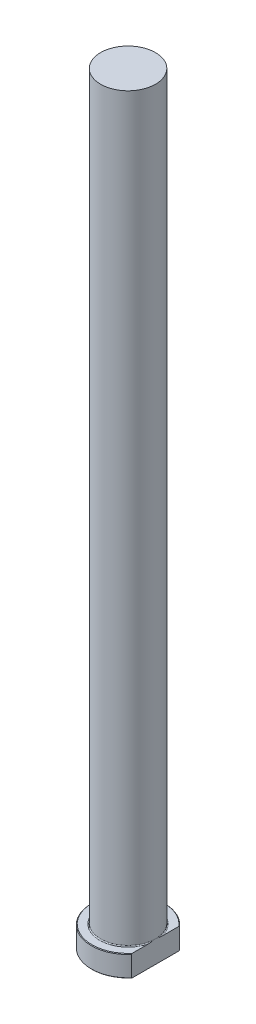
ISO-10303-21;
HEADER;
FILE_DESCRIPTION(('STEP AP214'),'2;1');
FILE_NAME('part.step','',(''),(''),'','','');
FILE_SCHEMA(('AUTOMOTIVE_DESIGN { 1 0 10303 214 1 1 1 1 }'));
ENDSEC;
DATA;
#1=APPLICATION_CONTEXT('core data for automotive mechanical design processes');
#2=APPLICATION_PROTOCOL_DEFINITION('international standard','automotive_design',2000,#1);
#3=PRODUCT_CONTEXT('',#1,'mechanical');
#4=PRODUCT('Part','Part','',(#3));
#5=PRODUCT_RELATED_PRODUCT_CATEGORY('part','',(#4));
#6=PRODUCT_DEFINITION_FORMATION('','',#4);
#7=PRODUCT_DEFINITION_CONTEXT('part definition',#1,'design');
#8=PRODUCT_DEFINITION('design','',#6,#7);
#9=PRODUCT_DEFINITION_SHAPE('','',#8);
#10=(LENGTH_UNIT() NAMED_UNIT(*) SI_UNIT(.MILLI.,.METRE.));
#11=(NAMED_UNIT(*) PLANE_ANGLE_UNIT() SI_UNIT($,.RADIAN.));
#12=(NAMED_UNIT(*) SI_UNIT($,.STERADIAN.) SOLID_ANGLE_UNIT());
#13=UNCERTAINTY_MEASURE_WITH_UNIT(LENGTH_MEASURE(1.E-05),#10,'distance_accuracy_value','');
#14=(GEOMETRIC_REPRESENTATION_CONTEXT(3) GLOBAL_UNCERTAINTY_ASSIGNED_CONTEXT((#13)) GLOBAL_UNIT_ASSIGNED_CONTEXT((#10,
#11,#12)) REPRESENTATION_CONTEXT('',''));
#15=CARTESIAN_POINT('',(0.,0.,0.));
#16=DIRECTION('',(0.,0.,1.));
#17=DIRECTION('',(1.,0.,0.));
#18=AXIS2_PLACEMENT_3D('',#15,#16,#17);
#19=CARTESIAN_POINT('',(0.,0.,0.));
#20=DIRECTION('',(0.,-1.,0.));
#21=DIRECTION('',(0.,0.,-1.));
#22=AXIS2_PLACEMENT_3D('',#19,#20,#21);
#23=PLANE('',#22);
#24=CARTESIAN_POINT('',(0.,0.,0.));
#25=DIRECTION('',(0.,-1.,0.));
#26=DIRECTION('',(0.,0.,-1.));
#27=AXIS2_PLACEMENT_3D('',#24,#25,#26);
#28=CIRCLE('',#27,11.8);
#29=CARTESIAN_POINT('',(8.99999999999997,0.,7.63151361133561));
#30=VERTEX_POINT('',#29);
#31=CARTESIAN_POINT('',(8.99999999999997,0.,-7.63151361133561));
#32=VERTEX_POINT('',#31);
#33=EDGE_CURVE('E98',#30,#32,#28,.T.);
#34=ORIENTED_EDGE('',*,*,#33,.T.);
#35=DIRECTION('',(0.,0.,1.));
#36=VECTOR('',#35,1.);
#37=CARTESIAN_POINT('',(8.99999999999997,0.,-7.93725393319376));
#38=LINE('',#37,#36);
#39=EDGE_CURVE('E83',#32,#30,#38,.T.);
#40=ORIENTED_EDGE('',*,*,#39,.T.);
#41=EDGE_LOOP('',(#34,#40));
#42=FACE_BOUND('',#41,.T.);
#43=ADVANCED_FACE('F32',(#42),#23,.T.);
#44=CARTESIAN_POINT('',(0.,259.958771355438,0.));
#45=DIRECTION('',(0.,1.,0.));
#46=DIRECTION('',(0.,0.,1.));
#47=AXIS2_PLACEMENT_3D('',#44,#45,#46);
#48=CYLINDRICAL_SURFACE('',#47,12.);
#49=CARTESIAN_POINT('',(0.,6.79999999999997,0.));
#50=DIRECTION('',(0.,1.,0.));
#51=DIRECTION('',(0.,0.,1.));
#52=AXIS2_PLACEMENT_3D('',#49,#50,#51);
#53=CIRCLE('',#52,12.);
#54=CARTESIAN_POINT('',(8.99999999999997,6.79999999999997,7.93725393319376));
#55=VERTEX_POINT('',#54);
#56=CARTESIAN_POINT('',(8.99999999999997,6.79999999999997,-7.93725393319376));
#57=VERTEX_POINT('',#56);
#58=EDGE_CURVE('E104',#55,#57,#53,.F.);
#59=ORIENTED_EDGE('',*,*,#58,.T.);
#60=DIRECTION('',(0.,-1.,0.));
#61=VECTOR('',#60,1.);
#62=CARTESIAN_POINT('',(8.99999999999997,250.,-7.93725393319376));
#63=LINE('',#62,#61);
#64=CARTESIAN_POINT('',(8.99999999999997,0.199999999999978,-7.93725393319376));
#65=VERTEX_POINT('',#64);
#66=EDGE_CURVE('E183',#57,#65,#63,.T.);
#67=ORIENTED_EDGE('',*,*,#66,.T.);
#68=CARTESIAN_POINT('',(0.,0.199999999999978,0.));
#69=DIRECTION('',(0.,-1.,0.));
#70=DIRECTION('',(0.,0.,-1.));
#71=AXIS2_PLACEMENT_3D('',#68,#69,#70);
#72=CIRCLE('',#71,12.);
#73=CARTESIAN_POINT('',(8.99999999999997,0.199999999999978,7.93725393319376));
#74=VERTEX_POINT('',#73);
#75=EDGE_CURVE('E100',#65,#74,#72,.F.);
#76=ORIENTED_EDGE('',*,*,#75,.T.);
#77=DIRECTION('',(0.,-1.,0.));
#78=VECTOR('',#77,1.);
#79=CARTESIAN_POINT('',(8.99999999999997,250.,7.93725393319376));
#80=LINE('',#79,#78);
#81=EDGE_CURVE('E93',#55,#74,#80,.T.);
#82=ORIENTED_EDGE('',*,*,#81,.F.);
#83=EDGE_LOOP('',(#59,#67,#76,#82));
#84=FACE_BOUND('',#83,.T.);
#85=ADVANCED_FACE('F158',(#84),#48,.T.);
#86=CARTESIAN_POINT('',(-12.,7.,0.));
#87=DIRECTION('',(0.,1.,0.));
#88=DIRECTION('',(0.,0.,1.));
#89=AXIS2_PLACEMENT_3D('',#86,#87,#88);
#90=PLANE('',#89);
#91=CARTESIAN_POINT('',(0.,7.,0.));
#92=DIRECTION('',(0.,1.,0.));
#93=DIRECTION('',(0.,0.,1.));
#94=AXIS2_PLACEMENT_3D('',#91,#92,#93);
#95=CIRCLE('',#94,11.8);
#96=CARTESIAN_POINT('',(8.99999999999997,7.,-7.63151361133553));
#97=VERTEX_POINT('',#96);
#98=CARTESIAN_POINT('',(8.99999999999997,7.,7.63151361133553));
#99=VERTEX_POINT('',#98);
#100=EDGE_CURVE('E178',#97,#99,#95,.T.);
#101=ORIENTED_EDGE('',*,*,#100,.T.);
#102=DIRECTION('',(0.,0.,-1.));
#103=VECTOR('',#102,1.);
#104=CARTESIAN_POINT('',(8.99999999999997,7.,0.));
#105=LINE('',#104,#103);
#106=CARTESIAN_POINT('',(8.99999999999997,6.99999999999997,2.34307490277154));
#107=VERTEX_POINT('',#106);
#108=EDGE_CURVE('E57',#99,#107,#105,.T.);
#109=ORIENTED_EDGE('',*,*,#108,.T.);
#110=CARTESIAN_POINT('',(0.,7.,0.));
#111=DIRECTION('',(0.,1.,0.));
#112=DIRECTION('',(0.,0.,1.));
#113=AXIS2_PLACEMENT_3D('',#110,#111,#112);
#114=CIRCLE('',#113,9.29999999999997);
#115=CARTESIAN_POINT('',(8.99999999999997,6.99999999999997,-2.34307490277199));
#116=VERTEX_POINT('',#115);
#117=EDGE_CURVE('E107',#107,#116,#114,.F.);
#118=ORIENTED_EDGE('',*,*,#117,.T.);
#119=EDGE_CURVE('E136',#116,#97,#105,.T.);
#120=ORIENTED_EDGE('',*,*,#119,.T.);
#121=EDGE_LOOP('',(#101,#109,#118,#120));
#122=FACE_BOUND('',#121,.T.);
#123=ADVANCED_FACE('F147',(#122),#90,.T.);
#124=CARTESIAN_POINT('',(0.,7.00000000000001,0.));
#125=DIRECTION('',(0.,-1.,0.));
#126=DIRECTION('',(0.,0.,-1.));
#127=AXIS2_PLACEMENT_3D('',#124,#125,#126);
#128=CONICAL_SURFACE('',#127,11.7999999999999,0.785398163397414);
#129=ORIENTED_EDGE('',*,*,#58,.F.);
#130=CARTESIAN_POINT('',(8.99999999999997,-0.845696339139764,17.4629145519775));
#131=CARTESIAN_POINT('',(8.99999999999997,-0.619168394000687,17.2080654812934));
#132=CARTESIAN_POINT('',(8.99999999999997,-0.393215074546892,16.9527052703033));
#133=CARTESIAN_POINT('',(8.99999999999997,0.0573779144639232,16.4408231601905));
#134=CARTESIAN_POINT('',(8.99999999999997,0.282017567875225,16.1843012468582));
#135=CARTESIAN_POINT('',(8.99999999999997,0.953874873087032,15.4126051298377));
#136=CARTESIAN_POINT('',(8.99999999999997,1.39886493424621,14.8954867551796));
#137=CARTESIAN_POINT('',(8.99999999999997,2.28707339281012,13.8475750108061));
#138=CARTESIAN_POINT('',(8.99999999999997,2.73018564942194,13.3166913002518));
#139=CARTESIAN_POINT('',(8.99999999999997,3.38667359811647,12.5137605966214));
#140=CARTESIAN_POINT('',(8.99999999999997,3.60411991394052,12.2450411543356));
#141=CARTESIAN_POINT('',(8.99999999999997,4.03580182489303,11.7050379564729));
#142=CARTESIAN_POINT('',(8.99999999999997,4.25003746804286,11.4337542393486));
#143=CARTESIAN_POINT('',(8.99999999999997,4.66485476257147,10.9008707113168));
#144=CARTESIAN_POINT('',(8.99999999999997,4.8656088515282,10.6394052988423));
#145=CARTESIAN_POINT('',(8.99999999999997,5.26299613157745,10.1133666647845));
#146=CARTESIAN_POINT('',(8.99999999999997,5.45962943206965,9.84879352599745));
#147=CARTESIAN_POINT('',(8.99999999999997,5.84808590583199,9.31586751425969));
#148=CARTESIAN_POINT('',(8.99999999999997,6.039905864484,9.04751229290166));
#149=CARTESIAN_POINT('',(8.99999999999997,6.41755379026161,8.5066135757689));
#150=CARTESIAN_POINT('',(8.99999999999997,6.60338186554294,8.23407015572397));
#151=CARTESIAN_POINT('',(8.99999999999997,6.96709703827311,7.68503423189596));
#152=CARTESIAN_POINT('',(8.99999999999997,7.14500871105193,7.40855806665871));
#153=CARTESIAN_POINT('',(8.99999999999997,7.49185621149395,6.84996824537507));
#154=CARTESIAN_POINT('',(8.99999999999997,7.66079116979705,6.56785404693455));
#155=CARTESIAN_POINT('',(8.99999999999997,7.98727106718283,5.99747808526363));
#156=CARTESIAN_POINT('',(8.99999999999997,8.14482812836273,5.70922330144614));
#157=CARTESIAN_POINT('',(8.99999999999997,8.4458607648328,5.12549650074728));
#158=CARTESIAN_POINT('',(8.99999999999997,8.58934045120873,4.83002662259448));
#159=CARTESIAN_POINT('',(8.99999999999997,8.84906483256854,4.25238874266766));
#160=CARTESIAN_POINT('',(8.99999999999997,8.96652090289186,3.97076984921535));
#161=CARTESIAN_POINT('',(8.99999999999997,9.1826864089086,3.40034514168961));
#162=CARTESIAN_POINT('',(8.99999999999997,9.28139598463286,3.1115393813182));
#163=CARTESIAN_POINT('',(8.99999999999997,9.4556676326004,2.52852903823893));
#164=CARTESIAN_POINT('',(8.99999999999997,9.53134480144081,2.23435935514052));
#165=CARTESIAN_POINT('',(8.99999999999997,9.65632576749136,1.64041484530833));
#166=CARTESIAN_POINT('',(8.99999999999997,9.70563300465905,1.34064075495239));
#167=CARTESIAN_POINT('',(8.99999999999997,9.77526514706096,0.73345334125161));
#168=CARTESIAN_POINT('',(8.99999999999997,9.79517814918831,0.425991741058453));
#169=CARTESIAN_POINT('',(8.99999999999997,9.80326622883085,-0.189338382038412));
#170=CARTESIAN_POINT('',(8.99999999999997,9.7914430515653,-0.497206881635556));
#171=CARTESIAN_POINT('',(8.99999999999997,9.73685194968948,-1.11106012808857));
#172=CARTESIAN_POINT('',(8.99999999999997,9.69399186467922,-1.41703652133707));
#173=CARTESIAN_POINT('',(8.99999999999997,9.58011156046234,-2.02367348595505));
#174=CARTESIAN_POINT('',(8.99999999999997,9.50908374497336,-2.32433260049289));
#175=CARTESIAN_POINT('',(8.99999999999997,9.31275981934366,-3.02635448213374));
#176=CARTESIAN_POINT('',(8.99999999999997,9.17712713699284,-3.42480429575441));
#177=CARTESIAN_POINT('',(8.99999999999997,8.87133996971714,-4.20817933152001));
#178=CARTESIAN_POINT('',(8.99999999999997,8.70116358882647,-4.59309579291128));
#179=CARTESIAN_POINT('',(8.99999999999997,8.42568509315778,-5.16277807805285));
#180=CARTESIAN_POINT('',(8.99999999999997,8.32997694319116,-5.3522881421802));
#181=CARTESIAN_POINT('',(8.99999999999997,8.13285287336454,-5.72832390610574));
#182=CARTESIAN_POINT('',(8.99999999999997,8.03143692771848,-5.91484959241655));
#183=CARTESIAN_POINT('',(8.99999999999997,7.8237269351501,-6.28506428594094));
#184=CARTESIAN_POINT('',(8.99999999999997,7.71743466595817,-6.46875429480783));
#185=CARTESIAN_POINT('',(8.99999999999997,7.50059460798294,-6.83359939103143));
#186=CARTESIAN_POINT('',(8.99999999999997,7.39004682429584,-7.01475448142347));
#187=CARTESIAN_POINT('',(8.99999999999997,7.12884885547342,-7.4330641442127));
#188=CARTESIAN_POINT('',(8.99999999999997,6.9768081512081,-7.66934990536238));
#189=CARTESIAN_POINT('',(8.99999999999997,6.66732030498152,-8.13836281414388));
#190=CARTESIAN_POINT('',(8.99999999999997,6.50987281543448,-8.37108973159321));
#191=CARTESIAN_POINT('',(8.99999999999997,6.19040265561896,-8.83345273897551));
#192=CARTESIAN_POINT('',(8.99999999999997,6.02837897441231,-9.06308812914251));
#193=CARTESIAN_POINT('',(8.99999999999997,5.70047733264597,-9.51959402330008));
#194=CARTESIAN_POINT('',(8.99999999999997,5.53459926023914,-9.74646444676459));
#195=CARTESIAN_POINT('',(8.99999999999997,5.03154469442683,-10.4241247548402));
#196=CARTESIAN_POINT('',(8.99999999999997,4.68944039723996,-10.8712583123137));
#197=CARTESIAN_POINT('',(8.99999999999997,3.9955806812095,-11.7578381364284));
#198=CARTESIAN_POINT('',(8.99999999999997,3.64382644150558,-12.1972853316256));
#199=CARTESIAN_POINT('',(8.99999999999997,2.95317269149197,-13.0452636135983));
#200=CARTESIAN_POINT('',(8.99999999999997,2.61468309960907,-13.4541293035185));
#201=CARTESIAN_POINT('',(8.99999999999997,1.93249184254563,-14.2675092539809));
#202=CARTESIAN_POINT('',(8.99999999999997,1.58878996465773,-14.6720233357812));
#203=CARTESIAN_POINT('',(8.99999999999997,0.898519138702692,-15.4759626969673));
#204=CARTESIAN_POINT('',(8.99999999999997,0.551965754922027,-15.8754013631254));
#205=CARTESIAN_POINT('',(8.99999999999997,-0.144511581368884,-16.6712645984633));
#206=CARTESIAN_POINT('',(8.99999999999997,-0.494435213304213,-17.0676894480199));
#207=CARTESIAN_POINT('',(8.99999999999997,-0.845696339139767,-17.4629145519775));
#208=B_SPLINE_CURVE_WITH_KNOTS('',3,(#130,#131,#132,#133,#134,#135,#136,#137,#138,#139,#140,
#141,#142,#143,#144,#145,#146,#147,#148,#149,#150,#151,#152,#153,#154,#155,#156,#157,#158,#159,
#160,#161,#162,#163,#164,#165,#166,#167,#168,#169,#170,#171,#172,#173,#174,#175,#176,#177,#178,
#179,#180,#181,#182,#183,#184,#185,#186,#187,#188,#189,#190,#191,#192,#193,#194,#195,#196,#197,
#198,#199,#200,#201,#202,#203,#204,#205,#206,#207),.UNSPECIFIED.,.F.,.F.,(4,2,2,2,2,2,2,2,2,2,2,
2,2,2,2,2,2,2,2,2,2,2,2,2,2,2,2,2,2,2,2,2,2,2,2,2,2,2,4),(0.,1.02291971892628,2.04585198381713,
4.09246471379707,6.16687312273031,7.20388686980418,8.24088509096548,9.22978878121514,
10.2186661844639,11.2081873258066,12.197690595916,13.1838703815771,14.1701455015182,
15.1553538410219,16.1402736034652,17.0551241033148,17.9699677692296,18.8801617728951,
19.7902370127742,20.7129479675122,21.6356081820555,22.5610194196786,23.4866803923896,
24.7471780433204,26.0084771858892,26.6453205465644,27.2821667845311,27.9187826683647,
28.5553977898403,29.3982316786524,30.2411198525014,31.0841957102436,31.9272960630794,
33.6160766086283,35.3046517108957,36.8969911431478,38.4893957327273,40.0758348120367,
41.6621244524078),.UNSPECIFIED.);
#209=EDGE_CURVE('E135',#55,#99,#208,.T.);
#210=ORIENTED_EDGE('',*,*,#209,.T.);
#211=ORIENTED_EDGE('',*,*,#100,.F.);
#212=EDGE_CURVE('E127',#97,#57,#208,.T.);
#213=ORIENTED_EDGE('',*,*,#212,.T.);
#214=EDGE_LOOP('',(#129,#210,#211,#213));
#215=FACE_BOUND('',#214,.T.);
#216=ADVANCED_FACE('F143',(#215),#128,.T.);
#217=CARTESIAN_POINT('',(0.,0.199999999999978,0.));
#218=DIRECTION('',(0.,1.,0.));
#219=DIRECTION('',(0.,0.,1.));
#220=AXIS2_PLACEMENT_3D('',#217,#218,#219);
#221=CONICAL_SURFACE('',#220,12.,0.785398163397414);
#222=ORIENTED_EDGE('',*,*,#75,.F.);
#223=CARTESIAN_POINT('',(8.99999999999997,7.84569633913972,-17.4629145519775));
#224=CARTESIAN_POINT('',(8.99999999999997,7.61916839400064,-17.2080654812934));
#225=CARTESIAN_POINT('',(8.99999999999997,7.39321507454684,-16.9527052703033));
#226=CARTESIAN_POINT('',(8.99999999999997,6.94262208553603,-16.4408231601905));
#227=CARTESIAN_POINT('',(8.99999999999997,6.71798243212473,-16.1843012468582));
#228=CARTESIAN_POINT('',(8.99999999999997,6.04612512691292,-15.4126051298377));
#229=CARTESIAN_POINT('',(8.99999999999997,5.60113506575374,-14.8954867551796));
#230=CARTESIAN_POINT('',(8.99999999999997,4.71292660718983,-13.8475750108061));
#231=CARTESIAN_POINT('',(8.99999999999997,4.26981435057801,-13.3166913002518));
#232=CARTESIAN_POINT('',(8.99999999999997,3.61332640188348,-12.5137605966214));
#233=CARTESIAN_POINT('',(8.99999999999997,3.39588008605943,-12.2450411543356));
#234=CARTESIAN_POINT('',(8.99999999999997,2.96419817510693,-11.7050379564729));
#235=CARTESIAN_POINT('',(8.99999999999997,2.74996253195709,-11.4337542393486));
#236=CARTESIAN_POINT('',(8.99999999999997,2.33514523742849,-10.9008707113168));
#237=CARTESIAN_POINT('',(8.99999999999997,2.13439114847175,-10.6394052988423));
#238=CARTESIAN_POINT('',(8.99999999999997,1.73700386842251,-10.1133666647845));
#239=CARTESIAN_POINT('',(8.99999999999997,1.5403705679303,-9.84879352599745));
#240=CARTESIAN_POINT('',(8.99999999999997,1.15191409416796,-9.3158675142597));
#241=CARTESIAN_POINT('',(8.99999999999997,0.960094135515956,-9.04751229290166));
#242=CARTESIAN_POINT('',(8.99999999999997,0.582446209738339,-8.5066135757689));
#243=CARTESIAN_POINT('',(8.99999999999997,0.396618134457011,-8.23407015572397));
#244=CARTESIAN_POINT('',(8.99999999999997,0.0329029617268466,-7.68503423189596));
#245=CARTESIAN_POINT('',(8.99999999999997,-0.145008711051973,-7.40855806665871));
#246=CARTESIAN_POINT('',(8.99999999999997,-0.491856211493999,-6.84996824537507));
#247=CARTESIAN_POINT('',(8.99999999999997,-0.660791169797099,-6.56785404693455));
#248=CARTESIAN_POINT('',(8.99999999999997,-0.987271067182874,-5.99747808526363));
#249=CARTESIAN_POINT('',(8.99999999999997,-1.14482812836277,-5.70922330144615));
#250=CARTESIAN_POINT('',(8.99999999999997,-1.44586076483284,-5.12549650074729));
#251=CARTESIAN_POINT('',(8.99999999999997,-1.58934045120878,-4.83002662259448));
#252=CARTESIAN_POINT('',(8.99999999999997,-1.84906483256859,-4.25238874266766));
#253=CARTESIAN_POINT('',(8.99999999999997,-1.96652090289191,-3.97076984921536));
#254=CARTESIAN_POINT('',(8.99999999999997,-2.18268640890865,-3.40034514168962));
#255=CARTESIAN_POINT('',(8.99999999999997,-2.2813959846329,-3.1115393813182));
#256=CARTESIAN_POINT('',(8.99999999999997,-2.45566763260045,-2.52852903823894));
#257=CARTESIAN_POINT('',(8.99999999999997,-2.53134480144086,-2.23435935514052));
#258=CARTESIAN_POINT('',(8.99999999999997,-2.65632576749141,-1.64041484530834));
#259=CARTESIAN_POINT('',(8.99999999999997,-2.7056330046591,-1.3406407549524));
#260=CARTESIAN_POINT('',(8.99999999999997,-2.77526514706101,-0.733453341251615));
#261=CARTESIAN_POINT('',(8.99999999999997,-2.79517814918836,-0.425991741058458));
#262=CARTESIAN_POINT('',(8.99999999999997,-2.8032662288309,0.189338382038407));
#263=CARTESIAN_POINT('',(8.99999999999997,-2.79144305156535,0.497206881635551));
#264=CARTESIAN_POINT('',(8.99999999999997,-2.73685194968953,1.11106012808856));
#265=CARTESIAN_POINT('',(8.99999999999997,-2.69399186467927,1.41703652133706));
#266=CARTESIAN_POINT('',(8.99999999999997,-2.58011156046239,2.02367348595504));
#267=CARTESIAN_POINT('',(8.99999999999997,-2.50908374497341,2.32433260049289));
#268=CARTESIAN_POINT('',(8.99999999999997,-2.31275981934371,3.02635448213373));
#269=CARTESIAN_POINT('',(8.99999999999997,-2.17712713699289,3.4248042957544));
#270=CARTESIAN_POINT('',(8.99999999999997,-1.8713399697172,4.20817933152));
#271=CARTESIAN_POINT('',(8.99999999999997,-1.70116358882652,4.59309579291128));
#272=CARTESIAN_POINT('',(8.99999999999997,-1.42568509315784,5.16277807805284));
#273=CARTESIAN_POINT('',(8.99999999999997,-1.32997694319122,5.35228814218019));
#274=CARTESIAN_POINT('',(8.99999999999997,-1.13285287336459,5.72832390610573));
#275=CARTESIAN_POINT('',(8.99999999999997,-1.03143692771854,5.91484959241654));
#276=CARTESIAN_POINT('',(8.99999999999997,-0.823726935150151,6.28506428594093));
#277=CARTESIAN_POINT('',(8.99999999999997,-0.717434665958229,6.46875429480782));
#278=CARTESIAN_POINT('',(8.99999999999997,-0.500594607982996,6.83359939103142));
#279=CARTESIAN_POINT('',(8.99999999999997,-0.390046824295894,7.01475448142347));
#280=CARTESIAN_POINT('',(8.99999999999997,-0.128848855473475,7.4330641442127));
#281=CARTESIAN_POINT('',(8.99999999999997,0.0231918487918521,7.66934990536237));
#282=CARTESIAN_POINT('',(8.99999999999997,0.332679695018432,8.13836281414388));
#283=CARTESIAN_POINT('',(8.99999999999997,0.490127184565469,8.37108973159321));
#284=CARTESIAN_POINT('',(8.99999999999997,0.809597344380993,8.83345273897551));
#285=CARTESIAN_POINT('',(8.99999999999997,0.971621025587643,9.06308812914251));
#286=CARTESIAN_POINT('',(8.99999999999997,1.29952266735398,9.51959402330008));
#287=CARTESIAN_POINT('',(8.99999999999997,1.46540073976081,9.74646444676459));
#288=CARTESIAN_POINT('',(8.99999999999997,1.96845530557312,10.4241247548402));
#289=CARTESIAN_POINT('',(8.99999999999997,2.31055960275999,10.8712583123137));
#290=CARTESIAN_POINT('',(8.99999999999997,3.00441931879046,11.7578381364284));
#291=CARTESIAN_POINT('',(8.99999999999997,3.35617355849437,12.1972853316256));
#292=CARTESIAN_POINT('',(8.99999999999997,4.04682730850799,13.0452636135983));
#293=CARTESIAN_POINT('',(8.99999999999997,4.38531690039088,13.4541293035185));
#294=CARTESIAN_POINT('',(8.99999999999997,5.06750815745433,14.2675092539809));
#295=CARTESIAN_POINT('',(8.99999999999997,5.41121003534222,14.6720233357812));
#296=CARTESIAN_POINT('',(8.99999999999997,6.10148086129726,15.4759626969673));
#297=CARTESIAN_POINT('',(8.99999999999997,6.44803424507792,15.8754013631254));
#298=CARTESIAN_POINT('',(8.99999999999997,7.14451158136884,16.6712645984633));
#299=CARTESIAN_POINT('',(8.99999999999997,7.49443521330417,17.0676894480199));
#300=CARTESIAN_POINT('',(8.99999999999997,7.84569633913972,17.4629145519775));
#301=B_SPLINE_CURVE_WITH_KNOTS('',3,(#223,#224,#225,#226,#227,#228,#229,#230,#231,#232,#233,
#234,#235,#236,#237,#238,#239,#240,#241,#242,#243,#244,#245,#246,#247,#248,#249,#250,#251,#252,
#253,#254,#255,#256,#257,#258,#259,#260,#261,#262,#263,#264,#265,#266,#267,#268,#269,#270,#271,
#272,#273,#274,#275,#276,#277,#278,#279,#280,#281,#282,#283,#284,#285,#286,#287,#288,#289,#290,
#291,#292,#293,#294,#295,#296,#297,#298,#299,#300),.UNSPECIFIED.,.F.,.F.,(4,2,2,2,2,2,2,2,2,2,2,
2,2,2,2,2,2,2,2,2,2,2,2,2,2,2,2,2,2,2,2,2,2,2,2,2,2,2,4),(0.,1.02291971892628,2.04585198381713,
4.09246471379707,6.16687312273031,7.20388686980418,8.24088509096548,9.22978878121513,
10.2186661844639,11.2081873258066,12.197690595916,13.1838703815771,14.1701455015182,
15.1553538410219,16.1402736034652,17.0551241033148,17.9699677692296,18.8801617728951,
19.7902370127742,20.7129479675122,21.6356081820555,22.5610194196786,23.4866803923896,
24.7471780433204,26.0084771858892,26.6453205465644,27.2821667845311,27.9187826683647,
28.5553977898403,29.3982316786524,30.2411198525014,31.0841957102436,31.9272960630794,
33.6160766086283,35.3046517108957,36.8969911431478,38.4893957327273,40.0758348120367,
41.6621244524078),.UNSPECIFIED.);
#302=EDGE_CURVE('E86',#65,#32,#301,.T.);
#303=ORIENTED_EDGE('',*,*,#302,.T.);
#304=ORIENTED_EDGE('',*,*,#33,.F.);
#305=EDGE_CURVE('E89',#30,#74,#301,.T.);
#306=ORIENTED_EDGE('',*,*,#305,.T.);
#307=EDGE_LOOP('',(#222,#303,#304,#306));
#308=FACE_BOUND('',#307,.T.);
#309=ADVANCED_FACE('F97',(#308),#221,.T.);
#310=CARTESIAN_POINT('',(0.,7.29999999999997,0.));
#311=DIRECTION('',(0.,1.,0.));
#312=DIRECTION('',(0.,0.,1.));
#313=AXIS2_PLACEMENT_3D('',#310,#311,#312);
#314=TOROIDAL_SURFACE('',#313,9.29999999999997,0.3);
#315=CARTESIAN_POINT('',(8.99999999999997,7.29999999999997,0.));
#316=CARTESIAN_POINT('',(8.99999999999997,7.30000063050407,1.40628521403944E-10));
#317=CARTESIAN_POINT('',(8.99999999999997,7.30000126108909,-3.72953344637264E-07));
#318=CARTESIAN_POINT('',(8.99999999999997,7.30000242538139,-1.31879172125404E-06));
#319=CARTESIAN_POINT('',(8.99999999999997,7.30000291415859,-1.91658985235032E-06));
#320=CARTESIAN_POINT('',(8.99999999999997,7.30000399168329,-3.38116402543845E-06));
#321=CARTESIAN_POINT('',(8.99999999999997,7.30000455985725,-4.27141237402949E-06));
#322=CARTESIAN_POINT('',(8.99999999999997,7.30000552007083,-6.05655817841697E-06));
#323=CARTESIAN_POINT('',(8.99999999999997,7.30000592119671,-6.9473471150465E-06));
#324=CARTESIAN_POINT('',(8.99999999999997,7.30000753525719,-1.06072217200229E-05));
#325=CARTESIAN_POINT('',(8.99999999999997,7.30000869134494,-1.34079715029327E-05));
#326=CARTESIAN_POINT('',(8.99999999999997,7.30001046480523,-1.87883419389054E-05));
#327=CARTESIAN_POINT('',(8.99999999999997,7.30001113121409,-2.13522964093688E-05));
#328=CARTESIAN_POINT('',(8.99999999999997,7.30001412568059,-3.27400407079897E-05));
#329=CARTESIAN_POINT('',(8.99999999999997,7.30001653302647,-4.15431816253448E-05));
#330=CARTESIAN_POINT('',(8.99999999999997,7.30001987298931,-5.77938726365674E-05));
#331=CARTESIAN_POINT('',(8.99999999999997,7.3000209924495,-6.5202010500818E-05));
#332=CARTESIAN_POINT('',(8.99999999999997,7.30002942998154,-0.000121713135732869));
#333=CARTESIAN_POINT('',(8.99999999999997,7.30003617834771,-0.000170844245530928));
#334=CARTESIAN_POINT('',(8.99999999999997,7.30006567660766,-0.00036702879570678));
#335=CARTESIAN_POINT('',(8.99999999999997,7.30009343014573,-0.00051334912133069));
#336=CARTESIAN_POINT('',(8.99999999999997,7.30020289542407,-0.00109844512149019));
#337=CARTESIAN_POINT('',(8.99999999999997,7.30028164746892,-0.00153755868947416));
#338=CARTESIAN_POINT('',(8.99999999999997,7.30059984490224,-0.00330079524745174));
#339=CARTESIAN_POINT('',(8.99999999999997,7.30084318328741,-0.00462444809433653));
#340=CARTESIAN_POINT('',(8.99999999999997,7.30186346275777,-0.0101867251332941));
#341=CARTESIAN_POINT('',(8.99999999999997,7.30263548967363,-0.0144259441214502));
#342=CARTESIAN_POINT('',(8.99999999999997,7.31325744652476,-0.0727359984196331));
#343=CARTESIAN_POINT('',(8.99999999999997,7.32313962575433,-0.1268031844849));
#344=CARTESIAN_POINT('',(8.99999999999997,7.34392153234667,-0.241097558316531));
#345=CARTESIAN_POINT('',(8.99999999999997,7.35480932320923,-0.301326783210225));
#346=CARTESIAN_POINT('',(8.99999999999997,7.37309736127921,-0.40343148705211));
#347=CARTESIAN_POINT('',(8.99999999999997,7.3805477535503,-0.445297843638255));
#348=CARTESIAN_POINT('',(8.99999999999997,7.39510453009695,-0.527858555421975));
#349=CARTESIAN_POINT('',(8.99999999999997,7.40221466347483,-0.568552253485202));
#350=CARTESIAN_POINT('',(8.99999999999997,7.43458159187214,-0.755924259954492));
#351=CARTESIAN_POINT('',(8.99999999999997,7.45890071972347,-0.902767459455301));
#352=CARTESIAN_POINT('',(8.99999999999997,7.5040883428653,-1.19870226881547));
#353=CARTESIAN_POINT('',(8.99999999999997,7.52491482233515,-1.34780055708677));
#354=CARTESIAN_POINT('',(8.99999999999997,7.55251893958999,-1.57943061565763));
#355=CARTESIAN_POINT('',(8.99999999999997,7.56140010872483,-1.66170929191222));
#356=CARTESIAN_POINT('',(8.99999999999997,7.57684365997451,-1.82648173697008));
#357=CARTESIAN_POINT('',(8.99999999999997,7.58340627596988,-1.90897548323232));
#358=CARTESIAN_POINT('',(8.99999999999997,7.59356547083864,-2.07383798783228));
#359=CARTESIAN_POINT('',(8.99999999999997,7.59717316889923,-2.15620603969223));
#360=CARTESIAN_POINT('',(8.99999999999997,7.60060935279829,-2.32101209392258));
#361=CARTESIAN_POINT('',(8.99999999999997,7.60043940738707,-2.40345005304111));
#362=CARTESIAN_POINT('',(8.99999999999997,7.59640131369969,-2.52537573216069));
#363=CARTESIAN_POINT('',(8.99999999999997,7.59450012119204,-2.56492910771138));
#364=CARTESIAN_POINT('',(8.99999999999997,7.58928802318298,-2.64396909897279));
#365=CARTESIAN_POINT('',(8.99999999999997,7.58597630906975,-2.68345566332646));
#366=CARTESIAN_POINT('',(8.99999999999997,7.57769868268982,-2.76177296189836));
#367=CARTESIAN_POINT('',(8.99999999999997,7.57275348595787,-2.80060581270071));
#368=CARTESIAN_POINT('',(8.99999999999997,7.56078540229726,-2.87793166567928));
#369=CARTESIAN_POINT('',(8.99999999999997,7.55376374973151,-2.91642485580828));
#370=CARTESIAN_POINT('',(8.99999999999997,7.53694450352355,-2.99313780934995));
#371=CARTESIAN_POINT('',(8.99999999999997,7.52712658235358,-3.03135338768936));
#372=CARTESIAN_POINT('',(8.99999999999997,7.50944673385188,-3.08780831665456));
#373=CARTESIAN_POINT('',(8.99999999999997,7.50305127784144,-3.10650508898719));
#374=CARTESIAN_POINT('',(8.99999999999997,7.48902548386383,-3.14342466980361));
#375=CARTESIAN_POINT('',(8.99999999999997,7.48139609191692,-3.16164782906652));
#376=CARTESIAN_POINT('',(8.99999999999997,7.46450585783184,-3.19743301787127));
#377=CARTESIAN_POINT('',(8.99999999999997,7.4552376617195,-3.2149916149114));
#378=CARTESIAN_POINT('',(8.99999999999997,7.43454972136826,-3.24876333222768));
#379=CARTESIAN_POINT('',(8.99999999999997,7.42314087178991,-3.26498269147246));
#380=CARTESIAN_POINT('',(8.99999999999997,7.40450419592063,-3.28646803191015));
#381=CARTESIAN_POINT('',(8.99999999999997,7.39850345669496,-3.29278935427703));
#382=CARTESIAN_POINT('',(8.99999999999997,7.38579421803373,-3.30471156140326));
#383=CARTESIAN_POINT('',(8.99999999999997,7.37908470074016,-3.31031138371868));
#384=CARTESIAN_POINT('',(8.99999999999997,7.36478588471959,-3.32053638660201));
#385=CARTESIAN_POINT('',(8.99999999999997,7.35718475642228,-3.32514544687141));
#386=CARTESIAN_POINT('',(8.99999999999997,7.34122980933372,-3.33278362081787));
#387=CARTESIAN_POINT('',(8.99999999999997,7.33287931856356,-3.33581935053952));
#388=CARTESIAN_POINT('',(8.99999999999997,7.31845330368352,-3.33919143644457));
#389=CARTESIAN_POINT('',(8.99999999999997,7.3125065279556,-3.34008113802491));
#390=CARTESIAN_POINT('',(8.99999999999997,7.30054756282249,-3.34082795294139));
#391=CARTESIAN_POINT('',(8.99999999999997,7.29453539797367,-3.34068544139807));
#392=CARTESIAN_POINT('',(8.99999999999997,7.28263753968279,-3.33938340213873));
#393=CARTESIAN_POINT('',(8.99999999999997,7.2767516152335,-3.3382259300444));
#394=CARTESIAN_POINT('',(8.99999999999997,7.26523345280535,-3.33500803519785));
#395=CARTESIAN_POINT('',(8.99999999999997,7.25960143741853,-3.33294683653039));
#396=CARTESIAN_POINT('',(8.99999999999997,7.24614810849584,-3.32695048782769));
#397=CARTESIAN_POINT('',(8.99999999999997,7.23851777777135,-3.32258952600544));
#398=CARTESIAN_POINT('',(8.99999999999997,7.22402940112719,-3.31273429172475));
#399=CARTESIAN_POINT('',(8.99999999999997,7.21717355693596,-3.3072369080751));
#400=CARTESIAN_POINT('',(8.99999999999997,7.19922025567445,-3.29098261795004));
#401=CARTESIAN_POINT('',(8.99999999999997,7.18887056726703,-3.27940951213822));
#402=CARTESIAN_POINT('',(8.99999999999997,7.16988044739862,-3.25496698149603));
#403=CARTESIAN_POINT('',(8.99999999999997,7.16124389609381,-3.24209471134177));
#404=CARTESIAN_POINT('',(8.99999999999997,7.14198013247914,-3.2101081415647));
#405=CARTESIAN_POINT('',(8.99999999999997,7.1320002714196,-3.1906083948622));
#406=CARTESIAN_POINT('',(8.99999999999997,7.11389041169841,-3.15075380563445));
#407=CARTESIAN_POINT('',(8.99999999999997,7.10576438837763,-3.13039723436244));
#408=CARTESIAN_POINT('',(8.99999999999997,7.09086324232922,-3.08897345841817));
#409=CARTESIAN_POINT('',(8.99999999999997,7.08410231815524,-3.06790120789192));
#410=CARTESIAN_POINT('',(8.99999999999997,7.07174209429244,-3.02545099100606));
#411=CARTESIAN_POINT('',(8.99999999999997,7.06614150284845,-3.00407339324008));
#412=CARTESIAN_POINT('',(8.99999999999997,7.05234584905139,-2.94629140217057));
#413=CARTESIAN_POINT('',(8.99999999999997,7.04502112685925,-2.90967972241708));
#414=CARTESIAN_POINT('',(8.99999999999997,7.03240402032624,-2.8361022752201));
#415=CARTESIAN_POINT('',(8.99999999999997,7.02711280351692,-2.79913631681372));
#416=CARTESIAN_POINT('',(8.99999999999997,7.01363050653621,-2.68772710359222));
#417=CARTESIAN_POINT('',(8.99999999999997,7.00787651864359,-2.61298996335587));
#418=CARTESIAN_POINT('',(8.99999999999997,7.00101064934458,-2.46619763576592));
#419=CARTESIAN_POINT('',(8.99999999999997,6.99973066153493,-2.39414846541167));
#420=CARTESIAN_POINT('',(8.99999999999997,7.0003597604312,-2.25048360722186));
#421=CARTESIAN_POINT('',(8.99999999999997,7.00225057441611,-2.17886780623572));
#422=CARTESIAN_POINT('',(8.99999999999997,7.00865827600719,-2.0325544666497));
#423=CARTESIAN_POINT('',(8.99999999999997,7.01328875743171,-1.95786225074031));
#424=CARTESIAN_POINT('',(8.99999999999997,7.0247141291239,-1.80868969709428));
#425=CARTESIAN_POINT('',(8.99999999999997,7.03150781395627,-1.73420926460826));
#426=CARTESIAN_POINT('',(8.99999999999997,7.04702589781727,-1.583650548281));
#427=CARTESIAN_POINT('',(8.99999999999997,7.05579262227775,-1.50757669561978));
#428=CARTESIAN_POINT('',(8.99999999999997,7.07482366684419,-1.35540828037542));
#429=CARTESIAN_POINT('',(8.99999999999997,7.08509200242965,-1.27931422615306));
#430=CARTESIAN_POINT('',(8.99999999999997,7.11096614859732,-1.09814766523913));
#431=CARTESIAN_POINT('',(8.99999999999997,7.12710877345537,-0.993152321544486));
#432=CARTESIAN_POINT('',(8.99999999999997,7.16076002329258,-0.784642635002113));
#433=CARTESIAN_POINT('',(8.99999999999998,7.17825049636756,-0.681125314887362));
#434=CARTESIAN_POINT('',(8.99999999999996,7.21207189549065,-0.486473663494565));
#435=CARTESIAN_POINT('',(8.99999999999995,7.22829584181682,-0.395320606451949));
#436=CARTESIAN_POINT('',(8.99999999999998,7.25335230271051,-0.256199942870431));
#437=CARTESIAN_POINT('',(9.,7.26204965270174,-0.208207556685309));
#438=CARTESIAN_POINT('',(8.99999999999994,7.27937243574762,-0.113033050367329));
#439=CARTESIAN_POINT('',(8.99999999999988,7.2879966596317,-0.0658507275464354));
#440=CARTESIAN_POINT('',(8.99999999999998,7.29736684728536,-0.0144131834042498));
#441=CARTESIAN_POINT('',(8.99999999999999,7.29814117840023,-0.0101611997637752));
#442=CARTESIAN_POINT('',(8.99999999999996,7.29916198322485,-0.00459610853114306));
#443=CARTESIAN_POINT('',(8.99999999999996,7.29940349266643,-0.00328239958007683));
#444=CARTESIAN_POINT('',(8.99999999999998,7.29971946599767,-0.00153148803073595));
#445=CARTESIAN_POINT('',(8.99999999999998,7.2997977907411,-0.00109475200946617));
#446=CARTESIAN_POINT('',(8.99999999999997,7.29990674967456,-0.000512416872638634));
#447=CARTESIAN_POINT('',(8.99999999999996,7.29993443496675,-0.000366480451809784));
#448=CARTESIAN_POINT('',(8.99999999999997,7.29996386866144,-0.00017073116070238));
#449=CARTESIAN_POINT('',(8.99999999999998,7.29997060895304,-0.000121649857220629));
#450=CARTESIAN_POINT('',(8.99999999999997,7.29997903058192,-6.51901500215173E-05));
#451=CARTESIAN_POINT('',(8.99999999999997,7.29998014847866,-5.7784383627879E-05));
#452=CARTESIAN_POINT('',(8.99999999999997,7.29998348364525,-4.15389236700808E-05));
#453=CARTESIAN_POINT('',(8.99999999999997,7.29998588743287,-3.27385309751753E-05));
#454=CARTESIAN_POINT('',(8.99999999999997,7.29998887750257,-2.13537218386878E-05));
#455=CARTESIAN_POINT('',(8.99999999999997,7.29998954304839,-1.87899411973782E-05));
#456=CARTESIAN_POINT('',(8.99999999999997,7.29999131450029,-1.34098146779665E-05));
#457=CARTESIAN_POINT('',(8.99999999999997,7.29999246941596,-1.0609109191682E-05));
#458=CARTESIAN_POINT('',(8.99999999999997,7.29999408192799,-6.94916941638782E-06));
#459=CARTESIAN_POINT('',(8.99999999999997,7.29999448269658,-6.05831006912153E-06));
#460=CARTESIAN_POINT('',(8.99999999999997,7.29999544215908,-4.27295929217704E-06));
#461=CARTESIAN_POINT('',(8.99999999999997,7.29999600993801,-3.38257168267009E-06));
#462=CARTESIAN_POINT('',(8.99999999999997,7.29999708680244,-1.91768845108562E-06));
#463=CARTESIAN_POINT('',(8.99999999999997,7.29999757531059,-1.3197344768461E-06));
#464=CARTESIAN_POINT('',(8.99999999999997,7.29999873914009,-3.73475936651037E-07));
#465=CARTESIAN_POINT('',(8.99999999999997,7.29999936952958,-1.40621003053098E-10));
#466=CARTESIAN_POINT('',(8.99999999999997,7.29999999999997,0.));
#467=B_SPLINE_CURVE_WITH_KNOTS('',3,(#315,#316,#317,#318,#319,#320,#321,#322,#323,#324,#325,
#326,#327,#328,#329,#330,#331,#332,#333,#334,#335,#336,#337,#338,#339,#340,#341,#342,#343,#344,
#345,#346,#347,#348,#349,#350,#351,#352,#353,#354,#355,#356,#357,#358,#359,#360,#361,#362,#363,
#364,#365,#366,#367,#368,#369,#370,#371,#372,#373,#374,#375,#376,#377,#378,#379,#380,#381,#382,
#383,#384,#385,#386,#387,#388,#389,#390,#391,#392,#393,#394,#395,#396,#397,#398,#399,#400,#401,
#402,#403,#404,#405,#406,#407,#408,#409,#410,#411,#412,#413,#414,#415,#416,#417,#418,#419,#420,
#421,#422,#423,#424,#425,#426,#427,#428,#429,#430,#431,#432,#433,#434,#435,#436,#437,#438,#439,
#440,#441,#442,#443,#444,#445,#446,#447,#448,#449,#450,#451,#452,#453,#454,#455,#456,#457,#458,
#459,#460,#461,#462,#463,#464,#465,#466),.UNSPECIFIED.,.T.,.F.,(4,2,2,2,2,2,2,2,2,2,2,2,2,2,2,2,
2,2,2,2,2,2,2,2,2,2,2,2,2,2,2,2,2,2,2,2,2,2,2,2,2,2,2,2,2,2,2,2,2,2,2,2,2,2,2,2,2,2,2,2,2,2,2,2,
2,2,2,2,2,2,2,2,2,2,2,4),(0.,1.9618165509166E-06,4.31785402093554E-06,7.45492696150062E-06,
1.03869199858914E-05,1.94514161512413E-05,2.73914962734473E-05,5.47432539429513E-05,
7.71990234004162E-05,0.000226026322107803,0.000672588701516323,0.00201119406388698,
0.00604839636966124,0.0189755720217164,0.183861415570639,0.367478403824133,0.495050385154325,
0.618980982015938,1.06548941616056,1.51703428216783,1.76527968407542,2.01350003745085,
2.26078200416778,2.50796128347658,2.62673893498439,2.74558477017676,2.86297785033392,
2.98030128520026,3.09850038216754,3.15775069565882,3.2169557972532,3.27643364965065,
3.33561662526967,3.36172163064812,3.38786464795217,3.41440531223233,3.4408334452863,
3.45879041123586,3.47674085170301,3.49465502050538,3.51258460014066,3.53879954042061,
3.56508722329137,3.61140219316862,3.65782089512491,3.72337768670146,3.78907376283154,
3.85542145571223,3.92169488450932,4.03362051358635,4.14561030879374,4.37025392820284,
4.58636028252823,4.80122553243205,5.02569406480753,5.25003773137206,5.47975187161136,
5.71009192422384,6.02876014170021,6.3437072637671,6.62146210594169,6.76778501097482,
6.91167467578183,6.92464076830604,6.92864764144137,6.92997899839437,6.93042439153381,
6.93057306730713,6.93059551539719,6.93062285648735,6.93063079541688,6.93063985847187,
6.93064279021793,6.93064592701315,6.93064828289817,6.93065024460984),.UNSPECIFIED.);
#468=CARTESIAN_POINT('',(8.99999999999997,7.29999999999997,0.));
#469=VERTEX_POINT('',#468);
#470=EDGE_CURVE('E11',#116,#469,#467,.T.);
#471=ORIENTED_EDGE('',*,*,#470,.F.);
#472=ORIENTED_EDGE('',*,*,#117,.F.);
#473=CARTESIAN_POINT('',(8.99999999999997,7.29999999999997,0.));
#474=CARTESIAN_POINT('',(8.99999999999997,7.29999936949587,-1.40628685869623E-10));
#475=CARTESIAN_POINT('',(8.99999999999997,7.29999873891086,3.72953344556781E-07));
#476=CARTESIAN_POINT('',(8.99999999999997,7.29999757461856,1.31879172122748E-06));
#477=CARTESIAN_POINT('',(8.99999999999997,7.29999708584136,1.9165898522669E-06));
#478=CARTESIAN_POINT('',(8.99999999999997,7.29999600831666,3.3811640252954E-06));
#479=CARTESIAN_POINT('',(8.99999999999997,7.2999954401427,4.27141237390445E-06));
#480=CARTESIAN_POINT('',(8.99999999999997,7.29999447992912,6.05655817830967E-06));
#481=CARTESIAN_POINT('',(8.99999999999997,7.29999407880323,6.94734711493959E-06));
#482=CARTESIAN_POINT('',(8.99999999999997,7.29999246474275,1.06072217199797E-05));
#483=CARTESIAN_POINT('',(8.99999999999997,7.299991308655,1.34079715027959E-05));
#484=CARTESIAN_POINT('',(8.99999999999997,7.29998953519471,1.87883419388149E-05));
#485=CARTESIAN_POINT('',(8.99999999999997,7.29998886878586,2.13522964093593E-05));
#486=CARTESIAN_POINT('',(8.99999999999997,7.29998587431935,3.2740040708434E-05));
#487=CARTESIAN_POINT('',(8.99999999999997,7.29998346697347,4.15431816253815E-05));
#488=CARTESIAN_POINT('',(8.99999999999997,7.29998012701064,5.77938726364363E-05));
#489=CARTESIAN_POINT('',(8.99999999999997,7.29997900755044,6.52020105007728E-05));
#490=CARTESIAN_POINT('',(8.99999999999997,7.29997057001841,0.000121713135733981));
#491=CARTESIAN_POINT('',(8.99999999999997,7.29996382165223,0.000170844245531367));
#492=CARTESIAN_POINT('',(8.99999999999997,7.29993432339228,0.000367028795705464));
#493=CARTESIAN_POINT('',(8.99999999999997,7.29990656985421,0.000513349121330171));
#494=CARTESIAN_POINT('',(8.99999999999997,7.29979710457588,0.00109844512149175));
#495=CARTESIAN_POINT('',(8.99999999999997,7.29971835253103,0.00153755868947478));
#496=CARTESIAN_POINT('',(8.99999999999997,7.29940015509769,0.00330079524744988));
#497=CARTESIAN_POINT('',(8.99999999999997,7.29915681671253,0.00462444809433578));
#498=CARTESIAN_POINT('',(8.99999999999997,7.29813653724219,0.0101867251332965));
#499=CARTESIAN_POINT('',(8.99999999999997,7.29736451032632,0.0144259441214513));
#500=CARTESIAN_POINT('',(8.99999999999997,7.28674255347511,0.0727359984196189));
#501=CARTESIAN_POINT('',(8.99999999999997,7.27686037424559,0.126803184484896));
#502=CARTESIAN_POINT('',(8.99999999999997,7.2560784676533,0.241097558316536));
#503=CARTESIAN_POINT('',(8.99999999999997,7.24519067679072,0.301326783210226));
#504=CARTESIAN_POINT('',(8.99999999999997,7.22690263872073,0.403431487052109));
#505=CARTESIAN_POINT('',(8.99999999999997,7.21945224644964,0.445297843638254));
#506=CARTESIAN_POINT('',(8.99999999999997,7.204895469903,0.527858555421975));
#507=CARTESIAN_POINT('',(8.99999999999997,7.19778533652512,0.568552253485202));
#508=CARTESIAN_POINT('',(8.99999999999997,7.1654184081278,0.755924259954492));
#509=CARTESIAN_POINT('',(8.99999999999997,7.14109928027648,0.902767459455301));
#510=CARTESIAN_POINT('',(8.99999999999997,7.09591165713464,1.19870226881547));
#511=CARTESIAN_POINT('',(8.99999999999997,7.0750851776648,1.34780055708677));
#512=CARTESIAN_POINT('',(8.99999999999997,7.04748106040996,1.57943061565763));
#513=CARTESIAN_POINT('',(8.99999999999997,7.03859989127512,1.66170929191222));
#514=CARTESIAN_POINT('',(8.99999999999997,7.02315634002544,1.82648173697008));
#515=CARTESIAN_POINT('',(8.99999999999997,7.01659372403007,1.90897548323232));
#516=CARTESIAN_POINT('',(8.99999999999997,7.00643452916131,2.07383798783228));
#517=CARTESIAN_POINT('',(8.99999999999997,7.00282683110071,2.15620603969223));
#518=CARTESIAN_POINT('',(8.99999999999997,6.99939064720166,2.32101209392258));
#519=CARTESIAN_POINT('',(8.99999999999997,6.99956059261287,2.40345005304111));
#520=CARTESIAN_POINT('',(8.99999999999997,7.00359868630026,2.52537573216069));
#521=CARTESIAN_POINT('',(8.99999999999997,7.00549987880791,2.56492910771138));
#522=CARTESIAN_POINT('',(8.99999999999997,7.01071197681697,2.64396909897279));
#523=CARTESIAN_POINT('',(8.99999999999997,7.01402369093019,2.68345566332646));
#524=CARTESIAN_POINT('',(8.99999999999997,7.02230131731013,2.76177296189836));
#525=CARTESIAN_POINT('',(8.99999999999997,7.02724651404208,2.80060581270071));
#526=CARTESIAN_POINT('',(8.99999999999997,7.03921459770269,2.87793166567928));
#527=CARTESIAN_POINT('',(8.99999999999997,7.04623625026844,2.91642485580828));
#528=CARTESIAN_POINT('',(8.99999999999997,7.0630554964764,2.99313780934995));
#529=CARTESIAN_POINT('',(8.99999999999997,7.07287341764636,3.03135338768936));
#530=CARTESIAN_POINT('',(8.99999999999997,7.09055326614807,3.08780831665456));
#531=CARTESIAN_POINT('',(8.99999999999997,7.09694872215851,3.10650508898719));
#532=CARTESIAN_POINT('',(8.99999999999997,7.11097451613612,3.14342466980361));
#533=CARTESIAN_POINT('',(8.99999999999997,7.11860390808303,3.16164782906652));
#534=CARTESIAN_POINT('',(8.99999999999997,7.1354941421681,3.19743301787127));
#535=CARTESIAN_POINT('',(8.99999999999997,7.14476233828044,3.2149916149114));
#536=CARTESIAN_POINT('',(8.99999999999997,7.16545027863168,3.24876333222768));
#537=CARTESIAN_POINT('',(8.99999999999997,7.17685912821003,3.26498269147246));
#538=CARTESIAN_POINT('',(8.99999999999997,7.19549580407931,3.28646803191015));
#539=CARTESIAN_POINT('',(8.99999999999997,7.20149654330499,3.29278935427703));
#540=CARTESIAN_POINT('',(8.99999999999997,7.21420578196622,3.30471156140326));
#541=CARTESIAN_POINT('',(8.99999999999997,7.22091529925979,3.31031138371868));
#542=CARTESIAN_POINT('',(8.99999999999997,7.23521411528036,3.32053638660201));
#543=CARTESIAN_POINT('',(8.99999999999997,7.24281524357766,3.32514544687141));
#544=CARTESIAN_POINT('',(8.99999999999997,7.25877019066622,3.33278362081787));
#545=CARTESIAN_POINT('',(8.99999999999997,7.26712068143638,3.33581935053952));
#546=CARTESIAN_POINT('',(8.99999999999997,7.28154669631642,3.33919143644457));
#547=CARTESIAN_POINT('',(8.99999999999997,7.28749347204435,3.34008113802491));
#548=CARTESIAN_POINT('',(8.99999999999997,7.29945243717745,3.34082795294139));
#549=CARTESIAN_POINT('',(8.99999999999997,7.30546460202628,3.34068544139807));
#550=CARTESIAN_POINT('',(8.99999999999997,7.31736246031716,3.33938340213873));
#551=CARTESIAN_POINT('',(8.99999999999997,7.32324838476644,3.3382259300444));
#552=CARTESIAN_POINT('',(8.99999999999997,7.33476654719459,3.33500803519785));
#553=CARTESIAN_POINT('',(8.99999999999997,7.34039856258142,3.33294683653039));
#554=CARTESIAN_POINT('',(8.99999999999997,7.3538518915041,3.32695048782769));
#555=CARTESIAN_POINT('',(8.99999999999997,7.3614822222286,3.32258952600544));
#556=CARTESIAN_POINT('',(8.99999999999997,7.37597059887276,3.31273429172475));
#557=CARTESIAN_POINT('',(8.99999999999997,7.38282644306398,3.3072369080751));
#558=CARTESIAN_POINT('',(8.99999999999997,7.4007797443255,3.29098261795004));
#559=CARTESIAN_POINT('',(8.99999999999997,7.41112943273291,3.27940951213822));
#560=CARTESIAN_POINT('',(8.99999999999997,7.43011955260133,3.25496698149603));
#561=CARTESIAN_POINT('',(8.99999999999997,7.43875610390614,3.24209471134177));
#562=CARTESIAN_POINT('',(8.99999999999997,7.45801986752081,3.2101081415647));
#563=CARTESIAN_POINT('',(8.99999999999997,7.46799972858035,3.1906083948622));
#564=CARTESIAN_POINT('',(8.99999999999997,7.48610958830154,3.15075380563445));
#565=CARTESIAN_POINT('',(8.99999999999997,7.49423561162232,3.13039723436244));
#566=CARTESIAN_POINT('',(8.99999999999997,7.50913675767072,3.08897345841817));
#567=CARTESIAN_POINT('',(8.99999999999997,7.51589768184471,3.06790120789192));
#568=CARTESIAN_POINT('',(8.99999999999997,7.52825790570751,3.02545099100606));
#569=CARTESIAN_POINT('',(8.99999999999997,7.5338584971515,3.00407339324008));
#570=CARTESIAN_POINT('',(8.99999999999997,7.54765415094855,2.94629140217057));
#571=CARTESIAN_POINT('',(8.99999999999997,7.5549788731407,2.90967972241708));
#572=CARTESIAN_POINT('',(8.99999999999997,7.56759597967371,2.8361022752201));
#573=CARTESIAN_POINT('',(8.99999999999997,7.57288719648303,2.79913631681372));
#574=CARTESIAN_POINT('',(8.99999999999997,7.58636949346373,2.68772710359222));
#575=CARTESIAN_POINT('',(8.99999999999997,7.59212348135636,2.61298996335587));
#576=CARTESIAN_POINT('',(8.99999999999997,7.59898935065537,2.46619763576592));
#577=CARTESIAN_POINT('',(8.99999999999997,7.60026933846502,2.39414846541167));
#578=CARTESIAN_POINT('',(8.99999999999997,7.59964023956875,2.25048360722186));
#579=CARTESIAN_POINT('',(8.99999999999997,7.59774942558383,2.17886780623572));
#580=CARTESIAN_POINT('',(8.99999999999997,7.59134172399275,2.0325544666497));
#581=CARTESIAN_POINT('',(8.99999999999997,7.58671124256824,1.95786225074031));
#582=CARTESIAN_POINT('',(8.99999999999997,7.57528587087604,1.80868969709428));
#583=CARTESIAN_POINT('',(8.99999999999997,7.56849218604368,1.73420926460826));
#584=CARTESIAN_POINT('',(8.99999999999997,7.55297410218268,1.58365054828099));
#585=CARTESIAN_POINT('',(8.99999999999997,7.5442073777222,1.50757669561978));
#586=CARTESIAN_POINT('',(8.99999999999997,7.52517633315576,1.35540828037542));
#587=CARTESIAN_POINT('',(8.99999999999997,7.51490799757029,1.27931422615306));
#588=CARTESIAN_POINT('',(8.99999999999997,7.48903385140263,1.09814766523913));
#589=CARTESIAN_POINT('',(8.99999999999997,7.47289122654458,0.993152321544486));
#590=CARTESIAN_POINT('',(8.99999999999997,7.43923997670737,0.784642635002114));
#591=CARTESIAN_POINT('',(8.99999999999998,7.42174950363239,0.681125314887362));
#592=CARTESIAN_POINT('',(8.99999999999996,7.3879281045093,0.486473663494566));
#593=CARTESIAN_POINT('',(8.99999999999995,7.37170415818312,0.395320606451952));
#594=CARTESIAN_POINT('',(8.99999999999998,7.34664769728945,0.25619994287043));
#595=CARTESIAN_POINT('',(9.,7.33795034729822,0.208207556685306));
#596=CARTESIAN_POINT('',(8.99999999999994,7.32062756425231,0.113033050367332));
#597=CARTESIAN_POINT('',(8.99999999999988,7.31200334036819,0.0658507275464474));
#598=CARTESIAN_POINT('',(8.99999999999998,7.3026331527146,0.0144131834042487));
#599=CARTESIAN_POINT('',(8.99999999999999,7.30185882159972,0.0101611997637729));
#600=CARTESIAN_POINT('',(8.99999999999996,7.30083801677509,0.00459610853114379));
#601=CARTESIAN_POINT('',(8.99999999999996,7.30059650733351,0.00328239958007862));
#602=CARTESIAN_POINT('',(8.99999999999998,7.30028053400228,0.00153148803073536));
#603=CARTESIAN_POINT('',(8.99999999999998,7.30020220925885,0.00109475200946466));
#604=CARTESIAN_POINT('',(8.99999999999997,7.30009325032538,0.000512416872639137));
#605=CARTESIAN_POINT('',(8.99999999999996,7.30006556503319,0.000366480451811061));
#606=CARTESIAN_POINT('',(8.99999999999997,7.30003613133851,0.000170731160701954));
#607=CARTESIAN_POINT('',(8.99999999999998,7.30002939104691,0.000121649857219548));
#608=CARTESIAN_POINT('',(8.99999999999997,7.30002096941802,6.51901500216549E-05));
#609=CARTESIAN_POINT('',(8.99999999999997,7.30001985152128,5.77843836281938E-05));
#610=CARTESIAN_POINT('',(8.99999999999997,7.3000165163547,4.15389236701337E-05));
#611=CARTESIAN_POINT('',(8.99999999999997,7.30001411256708,3.27385309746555E-05));
#612=CARTESIAN_POINT('',(8.99999999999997,7.30001112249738,2.13537218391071E-05));
#613=CARTESIAN_POINT('',(8.99999999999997,7.30001045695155,1.87899411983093E-05));
#614=CARTESIAN_POINT('',(8.99999999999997,7.30000868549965,1.34098146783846E-05));
#615=CARTESIAN_POINT('',(8.99999999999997,7.30000753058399,1.0609109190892E-05));
#616=CARTESIAN_POINT('',(8.99999999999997,7.30000591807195,6.94916941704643E-06));
#617=CARTESIAN_POINT('',(8.99999999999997,7.30000551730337,6.05831007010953E-06));
#618=CARTESIAN_POINT('',(8.99999999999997,7.30000455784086,4.2729592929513E-06));
#619=CARTESIAN_POINT('',(8.99999999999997,7.30000399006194,3.38257168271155E-06));
#620=CARTESIAN_POINT('',(8.99999999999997,7.30000291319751,1.91768845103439E-06));
#621=CARTESIAN_POINT('',(8.99999999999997,7.30000242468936,1.31973447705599E-06));
#622=CARTESIAN_POINT('',(8.99999999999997,7.30000126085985,3.73475936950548E-07));
#623=CARTESIAN_POINT('',(8.99999999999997,7.30000063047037,1.40621167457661E-10));
#624=CARTESIAN_POINT('',(8.99999999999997,7.29999999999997,0.));
#625=B_SPLINE_CURVE_WITH_KNOTS('',3,(#473,#474,#475,#476,#477,#478,#479,#480,#481,#482,#483,
#484,#485,#486,#487,#488,#489,#490,#491,#492,#493,#494,#495,#496,#497,#498,#499,#500,#501,#502,
#503,#504,#505,#506,#507,#508,#509,#510,#511,#512,#513,#514,#515,#516,#517,#518,#519,#520,#521,
#522,#523,#524,#525,#526,#527,#528,#529,#530,#531,#532,#533,#534,#535,#536,#537,#538,#539,#540,
#541,#542,#543,#544,#545,#546,#547,#548,#549,#550,#551,#552,#553,#554,#555,#556,#557,#558,#559,
#560,#561,#562,#563,#564,#565,#566,#567,#568,#569,#570,#571,#572,#573,#574,#575,#576,#577,#578,
#579,#580,#581,#582,#583,#584,#585,#586,#587,#588,#589,#590,#591,#592,#593,#594,#595,#596,#597,
#598,#599,#600,#601,#602,#603,#604,#605,#606,#607,#608,#609,#610,#611,#612,#613,#614,#615,#616,
#617,#618,#619,#620,#621,#622,#623,#624),.UNSPECIFIED.,.T.,.F.,(4,2,2,2,2,2,2,2,2,2,2,2,2,2,2,2,
2,2,2,2,2,2,2,2,2,2,2,2,2,2,2,2,2,2,2,2,2,2,2,2,2,2,2,2,2,2,2,2,2,2,2,2,2,2,2,2,2,2,2,2,2,2,2,2,
2,2,2,2,2,2,2,2,2,2,2,4),(0.,1.96181655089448E-06,4.31785402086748E-06,7.45492696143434E-06,
1.0386919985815E-05,1.94514161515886E-05,2.73914962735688E-05,5.47432539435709E-05,
7.71990234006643E-05,0.000226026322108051,0.000672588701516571,0.00201119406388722,
0.00604839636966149,0.0189755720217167,0.18386141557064,0.367478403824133,0.495050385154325,
0.618980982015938,1.06548941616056,1.51703428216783,1.76527968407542,2.01350003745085,
2.26078200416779,2.50796128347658,2.62673893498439,2.74558477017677,2.86297785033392,
2.98030128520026,3.09850038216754,3.15775069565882,3.2169557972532,3.27643364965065,
3.33561662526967,3.36172163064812,3.38786464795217,3.41440531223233,3.4408334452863,
3.45879041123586,3.47674085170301,3.49465502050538,3.51258460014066,3.53879954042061,
3.56508722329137,3.61140219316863,3.65782089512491,3.72337768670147,3.78907376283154,
3.85542145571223,3.92169488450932,4.03362051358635,4.14561030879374,4.37025392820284,
4.58636028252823,4.80122553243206,5.02569406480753,5.25003773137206,5.47975187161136,
5.71009192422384,6.02876014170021,6.3437072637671,6.62146210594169,6.76778501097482,
6.91167467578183,6.92464076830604,6.92864764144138,6.92997899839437,6.93042439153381,
6.93057306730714,6.93059551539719,6.93062285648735,6.93063079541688,6.93063985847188,
6.93064279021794,6.93064592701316,6.93064828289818,6.93065024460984),.UNSPECIFIED.);
#626=EDGE_CURVE('E46',#469,#107,#625,.T.);
#627=ORIENTED_EDGE('',*,*,#626,.F.);
#628=CARTESIAN_POINT('',(0.,7.29999999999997,0.));
#629=DIRECTION('',(0.,1.,0.));
#630=DIRECTION('',(0.,0.,1.));
#631=AXIS2_PLACEMENT_3D('',#628,#629,#630);
#632=CIRCLE('',#631,8.99999999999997);
#633=EDGE_CURVE('E103',#469,#469,#632,.T.);
#634=ORIENTED_EDGE('',*,*,#633,.F.);
#635=EDGE_LOOP('',(#471,#472,#627,#634));
#636=FACE_BOUND('',#635,.T.);
#637=ADVANCED_FACE('F34',(#636),#314,.F.);
#638=CARTESIAN_POINT('',(0.,259.958771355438,0.));
#639=DIRECTION('',(0.,1.,0.));
#640=DIRECTION('',(0.,0.,1.));
#641=AXIS2_PLACEMENT_3D('',#638,#639,#640);
#642=CYLINDRICAL_SURFACE('',#641,8.99999999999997);
#643=ORIENTED_EDGE('',*,*,#633,.T.);
#644=EDGE_LOOP('',(#643));
#645=FACE_BOUND('',#644,.T.);
#646=CARTESIAN_POINT('',(0.,250.,0.));
#647=DIRECTION('',(0.,1.,0.));
#648=DIRECTION('',(0.,0.,1.));
#649=AXIS2_PLACEMENT_3D('',#646,#647,#648);
#650=CIRCLE('',#649,8.99999999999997);
#651=CARTESIAN_POINT('',(0.,250.,8.99999999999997));
#652=VERTEX_POINT('',#651);
#653=EDGE_CURVE('E101',#652,#652,#650,.T.);
#654=ORIENTED_EDGE('',*,*,#653,.F.);
#655=EDGE_LOOP('',(#654));
#656=FACE_BOUND('',#655,.T.);
#657=ADVANCED_FACE('F155',(#645,#656),#642,.T.);
#658=CARTESIAN_POINT('',(-8.99999999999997,250.,0.));
#659=DIRECTION('',(0.,1.,0.));
#660=DIRECTION('',(0.,0.,1.));
#661=AXIS2_PLACEMENT_3D('',#658,#659,#660);
#662=PLANE('',#661);
#663=ORIENTED_EDGE('',*,*,#653,.T.);
#664=EDGE_LOOP('',(#663));
#665=FACE_BOUND('',#664,.T.);
#666=ADVANCED_FACE('F121',(#665),#662,.T.);
#667=CARTESIAN_POINT('',(8.99999999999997,250.,-7.93725393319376));
#668=DIRECTION('',(1.,0.,0.));
#669=DIRECTION('',(0.,0.,-1.));
#670=AXIS2_PLACEMENT_3D('',#667,#668,#669);
#671=PLANE('',#670);
#672=ORIENTED_EDGE('',*,*,#66,.F.);
#673=ORIENTED_EDGE('',*,*,#212,.F.);
#674=ORIENTED_EDGE('',*,*,#119,.F.);
#675=ORIENTED_EDGE('',*,*,#470,.T.);
#676=ORIENTED_EDGE('',*,*,#626,.T.);
#677=ORIENTED_EDGE('',*,*,#108,.F.);
#678=ORIENTED_EDGE('',*,*,#209,.F.);
#679=ORIENTED_EDGE('',*,*,#81,.T.);
#680=ORIENTED_EDGE('',*,*,#305,.F.);
#681=ORIENTED_EDGE('',*,*,#39,.F.);
#682=ORIENTED_EDGE('',*,*,#302,.F.);
#683=EDGE_LOOP('',(#672,#673,#674,#675,#676,#677,#678,#679,#680,#681,#682));
#684=FACE_BOUND('',#683,.T.);
#685=ADVANCED_FACE('F85',(#684),#671,.T.);
#686=CLOSED_SHELL('',(#43,#85,#123,#216,#309,#637,#657,#666,#685));
#687=MANIFOLD_SOLID_BREP('B2',#686);
#688=ADVANCED_BREP_SHAPE_REPRESENTATION('',(#18,#687),#14);
#689=SHAPE_DEFINITION_REPRESENTATION(#9,#688);
ENDSEC;
END-ISO-10303-21;
